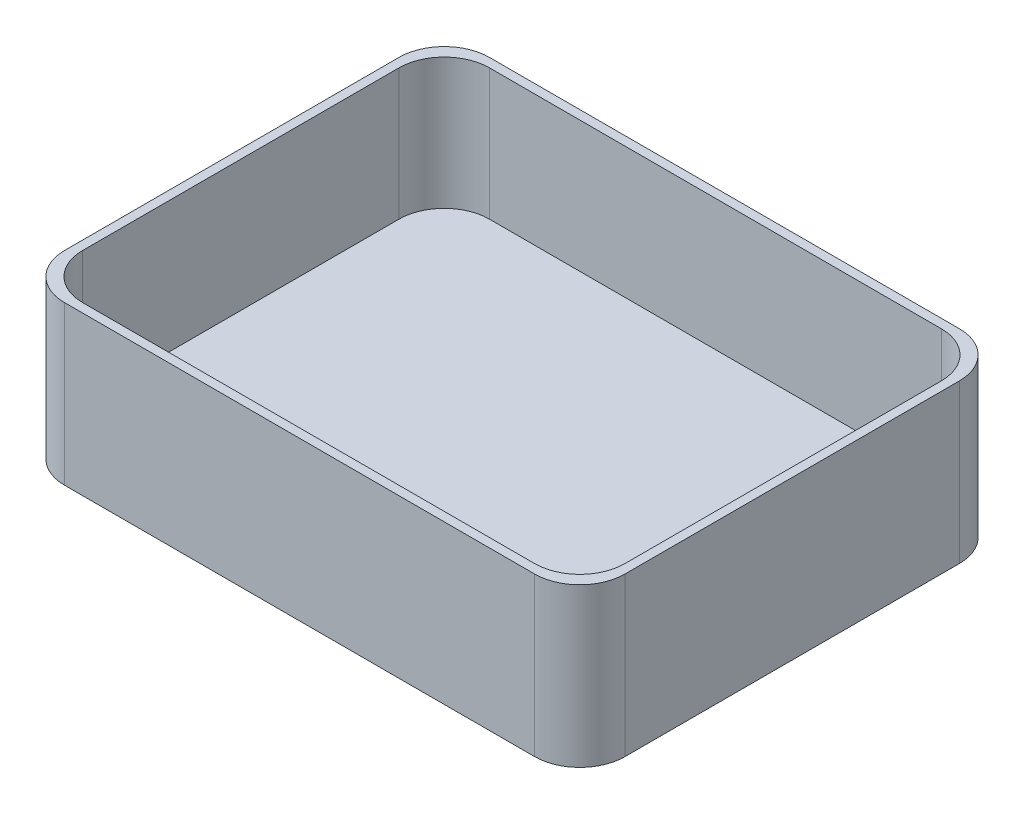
from build123d import *

# Parameters (mm, degrees)
SKETCH1_W           = 124
SKETCH1_H           = 94
BOSS_EXTRUDE1_DEPTH = 35
SKETCH2_W           = 120
SKETCH2_H           = 90
CUT_EXTRUDE1_DEPTH  = 29
FILLET1_R           = 10
FILLET2_R           = 10


with BuildPart() as part:
    # Sketch1 → Boss-Extrude1 (new body)
    with BuildSketch(Plane(origin=(0, 0, 0), x_dir=(1, 0, 0), z_dir=(0, 1, 0))):
        Rectangle(SKETCH1_W, SKETCH1_H)
    extrude(amount=BOSS_EXTRUDE1_DEPTH)

    # Sketch2 → Cut-Extrude1 (cut)
    with BuildSketch(Plane(origin=(0, 35, 0), x_dir=(1, 0, 0), z_dir=(0, 1, 0))):
        Rectangle(SKETCH2_W, SKETCH2_H)
    extrude(amount=-CUT_EXTRUDE1_DEPTH, mode=Mode.SUBTRACT)

    # Fillet1
    fillet1_edges = [part.edges().sort_by_distance(p)[0] for p in [
        (60, 20.5, -45),
        (60, 20.5, 45),
        (-60, 20.5, 45),
        (-60, 20.5, -45),
    ]]
    fillet(fillet1_edges, radius=FILLET1_R)

    # Fillet2
    fillet2_edges = [part.edges().sort_by_distance(p)[0] for p in [
        (62, 17.5, 47),
        (-62, 17.5, 47),
        (-62, 17.5, -47),
        (62, 17.5, -47),
    ]]
    fillet(fillet2_edges, radius=FILLET2_R)


solid = part.part
